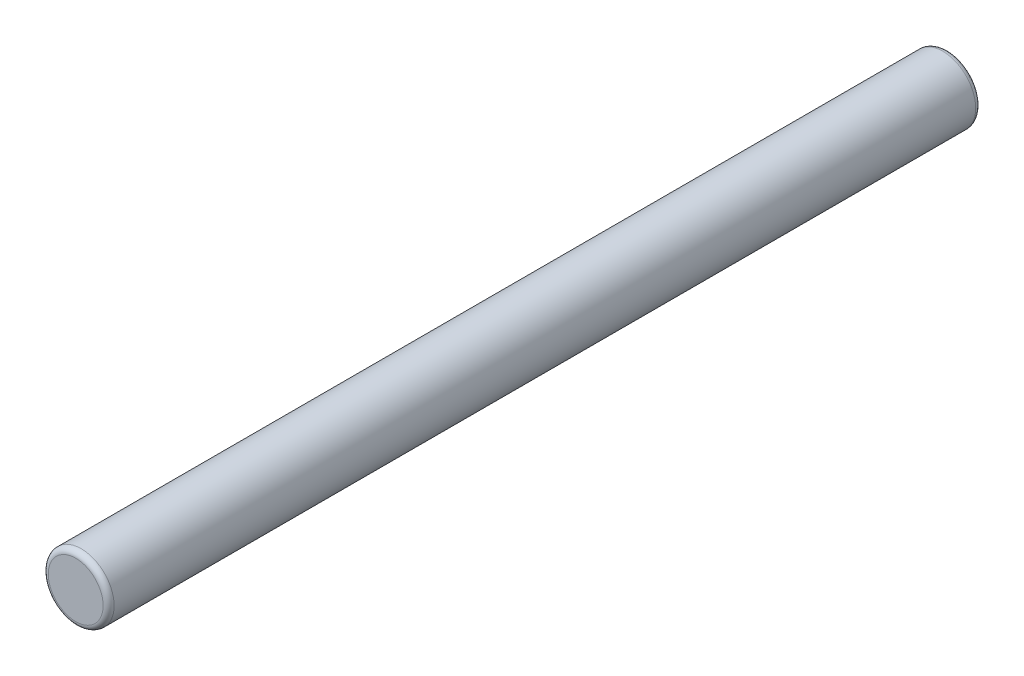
ISO-10303-21;
HEADER;
FILE_DESCRIPTION(('STEP AP214'),'2;1');
FILE_NAME('part.step','',(''),(''),'','','');
FILE_SCHEMA(('AUTOMOTIVE_DESIGN { 1 0 10303 214 1 1 1 1 }'));
ENDSEC;
DATA;
#1=APPLICATION_CONTEXT('core data for automotive mechanical design processes');
#2=APPLICATION_PROTOCOL_DEFINITION('international standard','automotive_design',2000,#1);
#3=PRODUCT_CONTEXT('',#1,'mechanical');
#4=PRODUCT('Part','Part','',(#3));
#5=PRODUCT_RELATED_PRODUCT_CATEGORY('part','',(#4));
#6=PRODUCT_DEFINITION_FORMATION('','',#4);
#7=PRODUCT_DEFINITION_CONTEXT('part definition',#1,'design');
#8=PRODUCT_DEFINITION('design','',#6,#7);
#9=PRODUCT_DEFINITION_SHAPE('','',#8);
#10=(LENGTH_UNIT() NAMED_UNIT(*) SI_UNIT(.MILLI.,.METRE.));
#11=(NAMED_UNIT(*) PLANE_ANGLE_UNIT() SI_UNIT($,.RADIAN.));
#12=(NAMED_UNIT(*) SI_UNIT($,.STERADIAN.) SOLID_ANGLE_UNIT());
#13=UNCERTAINTY_MEASURE_WITH_UNIT(LENGTH_MEASURE(1.E-05),#10,'distance_accuracy_value','');
#14=(GEOMETRIC_REPRESENTATION_CONTEXT(3) GLOBAL_UNCERTAINTY_ASSIGNED_CONTEXT((#13)) GLOBAL_UNIT_ASSIGNED_CONTEXT((#10,
#11,#12)) REPRESENTATION_CONTEXT('',''));
#15=CARTESIAN_POINT('',(0.,0.,0.));
#16=DIRECTION('',(0.,0.,1.));
#17=DIRECTION('',(1.,0.,0.));
#18=AXIS2_PLACEMENT_3D('',#15,#16,#17);
#19=CARTESIAN_POINT('',(0.,0.,79.5));
#20=DIRECTION('',(0.,0.,-1.));
#21=DIRECTION('',(-1.,0.,0.));
#22=AXIS2_PLACEMENT_3D('',#19,#20,#21);
#23=CYLINDRICAL_SURFACE('',#22,6.);
#24=CARTESIAN_POINT('',(0.,0.,-78.5));
#25=DIRECTION('',(0.,0.,1.));
#26=DIRECTION('',(1.,0.,0.));
#27=AXIS2_PLACEMENT_3D('',#24,#25,#26);
#28=CIRCLE('',#27,6.);
#29=CARTESIAN_POINT('',(-6.,0.,-78.5000000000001));
#30=VERTEX_POINT('',#29);
#31=EDGE_CURVE('E44',#30,#30,#28,.T.);
#32=CARTESIAN_POINT('',(0.,0.,78.5));
#33=DIRECTION('',(0.,0.,1.));
#34=DIRECTION('',(1.,0.,0.));
#35=AXIS2_PLACEMENT_3D('',#32,#33,#34);
#36=CIRCLE('',#35,6.);
#37=CARTESIAN_POINT('',(-6.,0.,78.5));
#38=VERTEX_POINT('',#37);
#39=EDGE_CURVE('E48',#38,#38,#36,.F.);
#40=CARTESIAN_POINT('',(-6.,0.,-78.5000000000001));
#41=CARTESIAN_POINT('',(-6.,0.,-76.8645833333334));
#42=CARTESIAN_POINT('',(-6.,0.,-75.2291666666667));
#43=CARTESIAN_POINT('',(-6.,0.,-71.9583333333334));
#44=CARTESIAN_POINT('',(-6.,0.,-70.3229166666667));
#45=CARTESIAN_POINT('',(-6.,0.,-67.0520833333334));
#46=CARTESIAN_POINT('',(-6.,0.,-65.4166666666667));
#47=CARTESIAN_POINT('',(-6.,0.,-62.1458333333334));
#48=CARTESIAN_POINT('',(-6.,0.,-60.5104166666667));
#49=CARTESIAN_POINT('',(-6.,0.,-57.2395833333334));
#50=CARTESIAN_POINT('',(-6.,0.,-55.6041666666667));
#51=CARTESIAN_POINT('',(-6.,0.,-52.3333333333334));
#52=CARTESIAN_POINT('',(-6.,0.,-50.6979166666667));
#53=CARTESIAN_POINT('',(-6.,0.,-47.4270833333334));
#54=CARTESIAN_POINT('',(-6.,0.,-45.7916666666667));
#55=CARTESIAN_POINT('',(-6.,0.,-42.5208333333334));
#56=CARTESIAN_POINT('',(-6.,0.,-40.8854166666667));
#57=CARTESIAN_POINT('',(-6.,0.,-37.6145833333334));
#58=CARTESIAN_POINT('',(-6.,0.,-35.9791666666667));
#59=CARTESIAN_POINT('',(-6.,0.,-32.7083333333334));
#60=CARTESIAN_POINT('',(-6.,0.,-31.0729166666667));
#61=CARTESIAN_POINT('',(-6.,0.,-27.8020833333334));
#62=CARTESIAN_POINT('',(-6.,0.,-26.1666666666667));
#63=CARTESIAN_POINT('',(-6.,0.,-22.8958333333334));
#64=CARTESIAN_POINT('',(-6.,0.,-21.2604166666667));
#65=CARTESIAN_POINT('',(-6.,0.,-17.9895833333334));
#66=CARTESIAN_POINT('',(-6.,0.,-16.3541666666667));
#67=CARTESIAN_POINT('',(-6.,0.,-13.0833333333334));
#68=CARTESIAN_POINT('',(-6.,0.,-11.4479166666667));
#69=CARTESIAN_POINT('',(-6.,0.,-8.17708333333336));
#70=CARTESIAN_POINT('',(-6.,0.,-6.5416666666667));
#71=CARTESIAN_POINT('',(-6.,0.,-3.27083333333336));
#72=CARTESIAN_POINT('',(-6.,0.,-1.63541666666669));
#73=CARTESIAN_POINT('',(-6.,0.,1.63541666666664));
#74=CARTESIAN_POINT('',(-6.,0.,3.27083333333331));
#75=CARTESIAN_POINT('',(-6.,0.,6.54166666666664));
#76=CARTESIAN_POINT('',(-6.,0.,8.17708333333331));
#77=CARTESIAN_POINT('',(-6.,0.,11.4479166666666));
#78=CARTESIAN_POINT('',(-6.,0.,13.0833333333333));
#79=CARTESIAN_POINT('',(-6.,0.,16.3541666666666));
#80=CARTESIAN_POINT('',(-6.,0.,17.9895833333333));
#81=CARTESIAN_POINT('',(-6.,0.,21.2604166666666));
#82=CARTESIAN_POINT('',(-6.,0.,22.8958333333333));
#83=CARTESIAN_POINT('',(-6.,0.,26.1666666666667));
#84=CARTESIAN_POINT('',(-6.,0.,27.8020833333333));
#85=CARTESIAN_POINT('',(-6.,0.,31.0729166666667));
#86=CARTESIAN_POINT('',(-6.,0.,32.7083333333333));
#87=CARTESIAN_POINT('',(-6.,0.,35.9791666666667));
#88=CARTESIAN_POINT('',(-6.,0.,37.6145833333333));
#89=CARTESIAN_POINT('',(-6.,0.,40.8854166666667));
#90=CARTESIAN_POINT('',(-6.,0.,42.5208333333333));
#91=CARTESIAN_POINT('',(-6.,0.,45.7916666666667));
#92=CARTESIAN_POINT('',(-6.,0.,47.4270833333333));
#93=CARTESIAN_POINT('',(-6.,0.,50.6979166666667));
#94=CARTESIAN_POINT('',(-6.,0.,52.3333333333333));
#95=CARTESIAN_POINT('',(-6.,0.,55.6041666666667));
#96=CARTESIAN_POINT('',(-6.,0.,57.2395833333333));
#97=CARTESIAN_POINT('',(-6.,0.,60.5104166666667));
#98=CARTESIAN_POINT('',(-6.,0.,62.1458333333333));
#99=CARTESIAN_POINT('',(-6.,0.,65.4166666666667));
#100=CARTESIAN_POINT('',(-6.,0.,67.0520833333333));
#101=CARTESIAN_POINT('',(-6.,0.,70.3229166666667));
#102=CARTESIAN_POINT('',(-6.,0.,71.9583333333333));
#103=CARTESIAN_POINT('',(-6.,0.,75.2291666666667));
#104=CARTESIAN_POINT('',(-6.,0.,76.8645833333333));
#105=CARTESIAN_POINT('',(-6.,0.,78.5));
#106=B_SPLINE_CURVE_WITH_KNOTS('',3,(#40,#41,#42,#43,#44,#45,#46,#47,#48,#49,#50,#51,#52,#53,
#54,#55,#56,#57,#58,#59,#60,#61,#62,#63,#64,#65,#66,#67,#68,#69,#70,#71,#72,#73,#74,#75,#76,#77,
#78,#79,#80,#81,#82,#83,#84,#85,#86,#87,#88,#89,#90,#91,#92,#93,#94,#95,#96,#97,#98,#99,#100,
#101,#102,#103,#104,#105),.UNSPECIFIED.,.F.,.F.,(4,2,2,2,2,2,2,2,2,2,2,2,2,2,2,2,2,2,2,2,2,2,2,
2,2,2,2,2,2,2,2,2,4),(0.,4.90625,9.8125,14.71875,19.625,24.53125,29.4375,34.34375,39.25,
44.15625,49.0625,53.96875,58.875,63.78125,68.6875,73.59375,78.5,83.40625,88.3125,93.21875,
98.125,103.03125,107.9375,112.84375,117.75,122.65625,127.5625,132.46875,137.375,142.28125,
147.1875,152.09375,157.),.UNSPECIFIED.);
#107=EDGE_CURVE('BSEAM33',#30,#38,#106,.T.);
#108=ORIENTED_EDGE('',*,*,#31,.T.);
#109=ORIENTED_EDGE('',*,*,#39,.T.);
#110=ORIENTED_EDGE('',*,*,#107,.T.);
#111=ORIENTED_EDGE('',*,*,#107,.F.);
#112=EDGE_LOOP('',(#108,#110,#109,#111));
#113=FACE_BOUND('',#112,.T.);
#114=ADVANCED_FACE('F33',(#113),#23,.T.);
#115=CARTESIAN_POINT('',(0.,0.,79.5));
#116=DIRECTION('',(0.,0.,1.));
#117=DIRECTION('',(1.,0.,0.));
#118=AXIS2_PLACEMENT_3D('',#115,#116,#117);
#119=PLANE('',#118);
#120=CARTESIAN_POINT('',(0.,0.,79.5));
#121=DIRECTION('',(0.,0.,1.));
#122=DIRECTION('',(1.,0.,0.));
#123=AXIS2_PLACEMENT_3D('',#120,#121,#122);
#124=CIRCLE('',#123,5.);
#125=CARTESIAN_POINT('',(5.,0.,79.5));
#126=VERTEX_POINT('',#125);
#127=EDGE_CURVE('E10',#126,#126,#124,.T.);
#128=ORIENTED_EDGE('',*,*,#127,.T.);
#129=EDGE_LOOP('',(#128));
#130=FACE_BOUND('',#129,.T.);
#131=ADVANCED_FACE('F64',(#130),#119,.T.);
#132=CARTESIAN_POINT('',(0.,0.,-79.5));
#133=DIRECTION('',(0.,0.,1.));
#134=DIRECTION('',(1.,0.,0.));
#135=AXIS2_PLACEMENT_3D('',#132,#133,#134);
#136=PLANE('',#135);
#137=CARTESIAN_POINT('',(0.,0.,-79.5));
#138=DIRECTION('',(0.,0.,1.));
#139=DIRECTION('',(1.,0.,0.));
#140=AXIS2_PLACEMENT_3D('',#137,#138,#139);
#141=CIRCLE('',#140,5.);
#142=CARTESIAN_POINT('',(5.,0.,-79.5));
#143=VERTEX_POINT('',#142);
#144=EDGE_CURVE('E40',#143,#143,#141,.F.);
#145=ORIENTED_EDGE('',*,*,#144,.T.);
#146=EDGE_LOOP('',(#145));
#147=FACE_BOUND('',#146,.T.);
#148=ADVANCED_FACE('F61',(#147),#136,.F.);
#149=CARTESIAN_POINT('',(0.,0.,-78.5));
#150=DIRECTION('',(0.,0.,1.));
#151=DIRECTION('',(1.,0.,0.));
#152=AXIS2_PLACEMENT_3D('',#149,#150,#151);
#153=TOROIDAL_SURFACE('',#152,5.,1.);
#154=ORIENTED_EDGE('',*,*,#144,.F.);
#155=EDGE_LOOP('',(#154));
#156=FACE_BOUND('',#155,.T.);
#157=ORIENTED_EDGE('',*,*,#31,.F.);
#158=EDGE_LOOP('',(#157));
#159=FACE_BOUND('',#158,.T.);
#160=ADVANCED_FACE('F57',(#156,#159),#153,.T.);
#161=CARTESIAN_POINT('',(0.,0.,78.5));
#162=DIRECTION('',(0.,0.,1.));
#163=DIRECTION('',(1.,0.,0.));
#164=AXIS2_PLACEMENT_3D('',#161,#162,#163);
#165=TOROIDAL_SURFACE('',#164,5.,1.);
#166=ORIENTED_EDGE('',*,*,#39,.F.);
#167=EDGE_LOOP('',(#166));
#168=FACE_BOUND('',#167,.T.);
#169=ORIENTED_EDGE('',*,*,#127,.F.);
#170=EDGE_LOOP('',(#169));
#171=FACE_BOUND('',#170,.T.);
#172=ADVANCED_FACE('F35',(#168,#171),#165,.T.);
#173=CLOSED_SHELL('',(#114,#131,#148,#160,#172));
#174=MANIFOLD_SOLID_BREP('B2',#173);
#175=ADVANCED_BREP_SHAPE_REPRESENTATION('',(#18,#174),#14);
#176=SHAPE_DEFINITION_REPRESENTATION(#9,#175);
ENDSEC;
END-ISO-10303-21;
